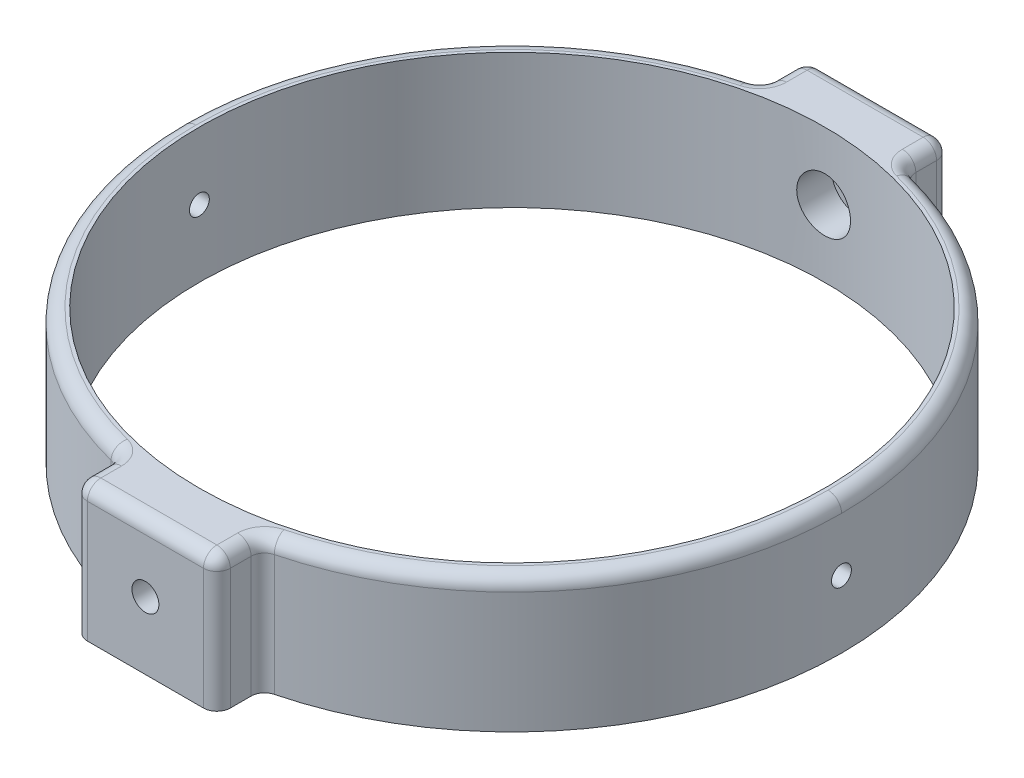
from build123d import *
from build123d.topology import SkipClean

# Parameters (mm, degrees)
BOSS_EXTRUDE1_DEPTH     = 20
SKETCH7_R               = 4
CUT_EXTRUDE4_DEPTH      = 7
SKETCH8_R               = 2
CUT_EXTRUDE5_DEPTH      = 74.846123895
FILLET1_R               = 2
FILLET1_OF_MIRROR3_R    = 2
CUT_EXTRUDE6_DEPTH      = 76.968743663
CUT_EXTRUDE6_DEPTH_BACK = 76.968743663
SKETCH9_R               = 1.475


with BuildPart() as part:
    # Sketch1 → Boss-Extrude1 (new body)
    with BuildSketch(Plane(origin=(0, 0, 0), x_dir=(1, 0, 0), z_dir=(0, 1, 0))):
        with BuildLine():
            ThreePointArc((49, 0), (38.221059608, 30.66187539), (10.626506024, 47.833851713))
            Line((10.626506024, 47.833851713), (10.626506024, 54.5))
            Line((10.626506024, 54.5), (-10.626506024, 54.5))
            Line((-10.626506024, 54.5), (-10.626506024, 47.833851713))
            ThreePointArc((-10.626506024, 47.833851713), (-38.221059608, 30.66187539), (-49, 0))
            Line((-49, 0), (-46.5, 0))
            ThreePointArc((-46.5, 0), (0, 46.5), (46.5, 0))
            Line((46.5, 0), (49, 0))
        make_face()
    boss_extrude1 = extrude(amount=BOSS_EXTRUDE1_DEPTH)

    # Sketch7 → Cut-Extrude4 (cut)
    with BuildSketch(Plane(origin=(0, 0, -51.5), x_dir=(-1, 0, 0), z_dir=(0, 0, -1))):
        with Locations((0, 10)):
            Circle(SKETCH7_R)
    cut_extrude4 = extrude(amount=-CUT_EXTRUDE4_DEPTH, mode=Mode.SUBTRACT)

    # Sketch8 → Cut-Extrude5 (cut, symmetric)
    with BuildSketch(Plane.XY.offset(-51.5)):
        with Locations(Location((0, 10, 0), (0, 0, 180))):
            Circle(SKETCH8_R)
    cut_extrude5 = extrude(amount=CUT_EXTRUDE5_DEPTH, both=True, mode=Mode.SUBTRACT)

    # Fillet1
    fillet1_edges = [part.edges().sort_by_distance(p)[0] for p in [
        (-10.626506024, 10, -47.833851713),
        (-10.626506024, 10, -54.5),
        (10.626506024, 10, -54.5),
        (10.626506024, 10, -47.833851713),
        (38.221059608, 20, -30.66187539),
        (10.626506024, 20, -51.166925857),
        (0, 20, -54.5),
        (-10.626506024, 20, -51.166925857),
        (-38.221059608, 20, -30.66187539),
    ]]
    fillet(fillet1_edges, radius=FILLET1_R)


with BuildPart() as mirror3_1:
    # Mirror3: Boss-Extrude1 across plane
    add(boss_extrude1.mirror(Plane(origin=(0, 20, 0), x_dir=(1, 0, 0), z_dir=(0, 0, -1))))

    # Mirror3 2: Cut-Extrude4, Cut-Extrude5 across plane
    add(cut_extrude4.mirror(Plane(origin=(0, 20, 0), x_dir=(1, 0, 0), z_dir=(0, 0, -1))), mode=Mode.SUBTRACT)
    add(cut_extrude5.mirror(Plane(origin=(0, 20, 0), x_dir=(1, 0, 0), z_dir=(0, 0, -1))), mode=Mode.SUBTRACT)

    # Fillet1 of Mirror3
    fillet1_of_mirror3_edges = [mirror3_1.edges().sort_by_distance(p)[0] for p in [
        (-10.626506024, 10, 47.833851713),
        (-10.626506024, 10, 54.5),
        (10.626506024, 10, 54.5),
        (10.626506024, 10, 47.833851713),
        (38.221059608, 20, 30.66187539),
        (10.626506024, 20, 51.166925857),
        (0, 20, 54.5),
        (-10.626506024, 20, 51.166925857),
        (-38.221059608, 20, 30.66187539),
    ]]
    fillet(fillet1_of_mirror3_edges, radius=FILLET1_OF_MIRROR3_R)


with BuildPart() as part_1:
    add(part.part)

    # Mirror3 united with what the copies touc: union Mirror3_1
    add(mirror3_1.part)

    # Sketch9 → Cut-Extrude6 (cut, two sides: drawn at the far end of the back side and taken through both)
    with SkipClean():  # the faces are left unmerged after this step: merging them gives an invalid solid
        with BuildSketch(Plane(origin=(0, 0, 0), x_dir=(0, 0, -1), z_dir=(1, 0, 0)).offset(-CUT_EXTRUDE6_DEPTH_BACK)):
            with Locations((0, 10)):
                Circle(SKETCH9_R)
        extrude(amount=CUT_EXTRUDE6_DEPTH + CUT_EXTRUDE6_DEPTH_BACK, mode=Mode.SUBTRACT)


solid = part_1.part
